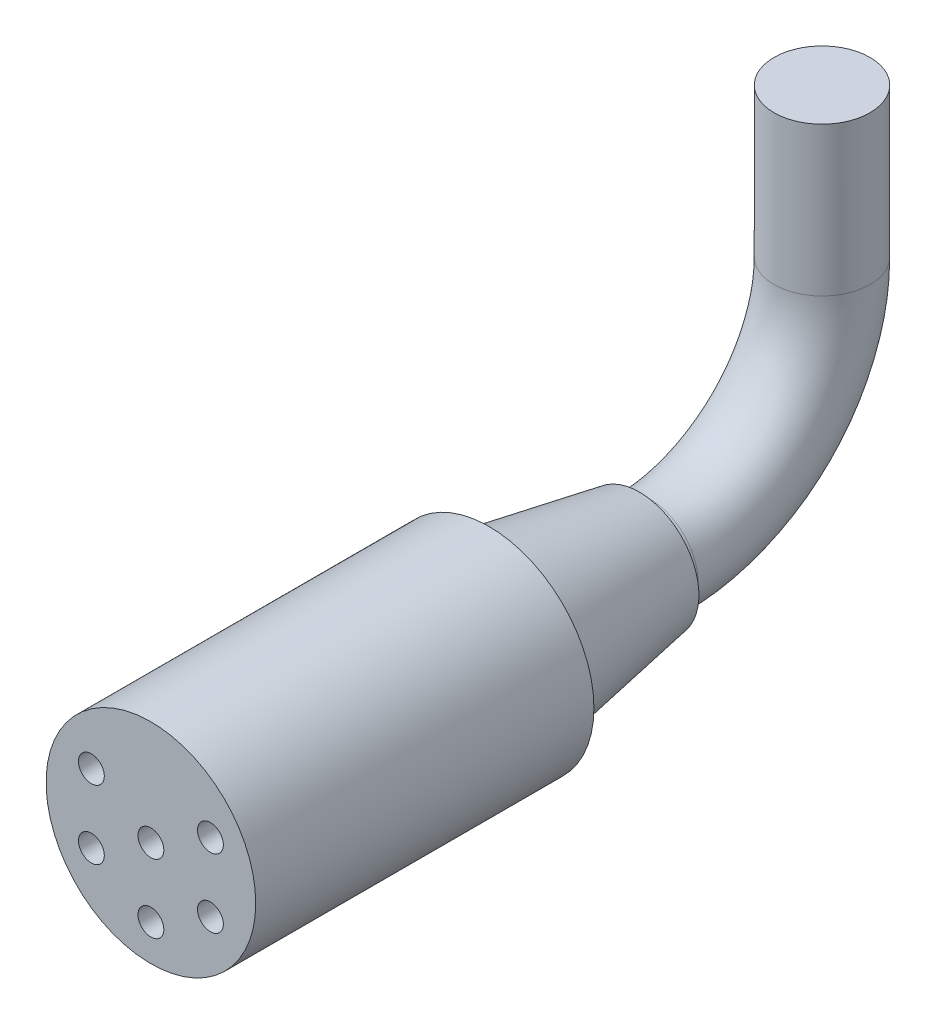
from build123d import *

# Parameters (mm, degrees)
SKETCH1_R                   = 7.747
EXTRUDE1_DEPTH              = 25.000000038
SKETCH6_R                   = 0.955
EXTRUDE9_DEPTH              = 10
CIRPATTERN3_COUNT           = 6
SKETCH8_R                   = 0.955
EXTRUDE10_DEPTH             = 10
SKETCH2_R                   = 6.352807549
EXTRUDE2_DEPTH              = 11.1125
EXTRUDE2_TAPER              = 10
SKETCH3_R                   = 3.5433
EXTRUDE3_DEPTH              = 0.79375
SKETCH5_R                   = 3.5433
BELDEN_3120ATYPE3PR24_ANGLE = 90
SKETCH13_R                  = 3.5433
EXTRUDE11_DEPTH             = 11


with BuildPart() as part:
    # Sketch1 → Extrude1 (new body)
    with BuildSketch(Plane.XY):
        Circle(SKETCH1_R)
    extrude(amount=-EXTRUDE1_DEPTH)

    # Sketch6 → Extrude9 (cut)
    with BuildSketch(Plane.XY):
        with Locations((0, -5.08)):
            Circle(SKETCH6_R)
    extrude9 = extrude(amount=-EXTRUDE9_DEPTH, mode=Mode.SUBTRACT)

    # CirPattern3: Extrude9 ×6 about axis, 1 skipped
    cirpattern3_axis = Axis((0, 0, 0), (0, 0, 1))
    add([extrude9.rotate(cirpattern3_axis, i * 360 / CIRPATTERN3_COUNT) for i in range(1, CIRPATTERN3_COUNT) if i not in (3,)], mode=Mode.SUBTRACT)

    # Sketch8 → Extrude10 (cut)
    with BuildSketch(Plane.XY):
        Circle(SKETCH8_R)
    extrude(amount=-EXTRUDE10_DEPTH, mode=Mode.SUBTRACT)

    # Sketch2 → Extrude2 (add)
    with BuildSketch(Plane(origin=(0, 0, -25.000000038), x_dir=(-1, 0, 0), z_dir=(0, 0, -1))):
        Circle(SKETCH2_R)
    extrude(amount=EXTRUDE2_DEPTH, taper=EXTRUDE2_TAPER)

    # Sketch3 → Extrude3 (add)
    with BuildSketch(Plane(origin=(0, 0, -36.112500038), x_dir=(-1, 0, 0), z_dir=(0, 0, -1))):
        Circle(SKETCH3_R)
    extrude(amount=EXTRUDE3_DEPTH)

    # Sketch5 → Belden 3120AType3PR24 (revolve)
    with BuildSketch(Plane(origin=(0, 0, -36.906250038), x_dir=(-1, 0, 0), z_dir=(0, 0, -1))):
        with Locations(Location((0, 0, 0), (0, 0, 270))):
            Circle(SKETCH5_R)
    revolve(axis=Axis((-38.976720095, 12.7, -36.906250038), (1, 0, 0)), revolution_arc=BELDEN_3120ATYPE3PR24_ANGLE)

    # Sketch13 → Extrude11 (add)
    with BuildSketch(Plane(origin=(0, 12.7, 0), x_dir=(1, 0, 0), z_dir=(0, 1, 0))):
        with Locations(Location((0, 49.606250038, 0), (0, 0, 90))):
            Circle(SKETCH13_R)
    extrude(amount=EXTRUDE11_DEPTH)


solid = part.part
